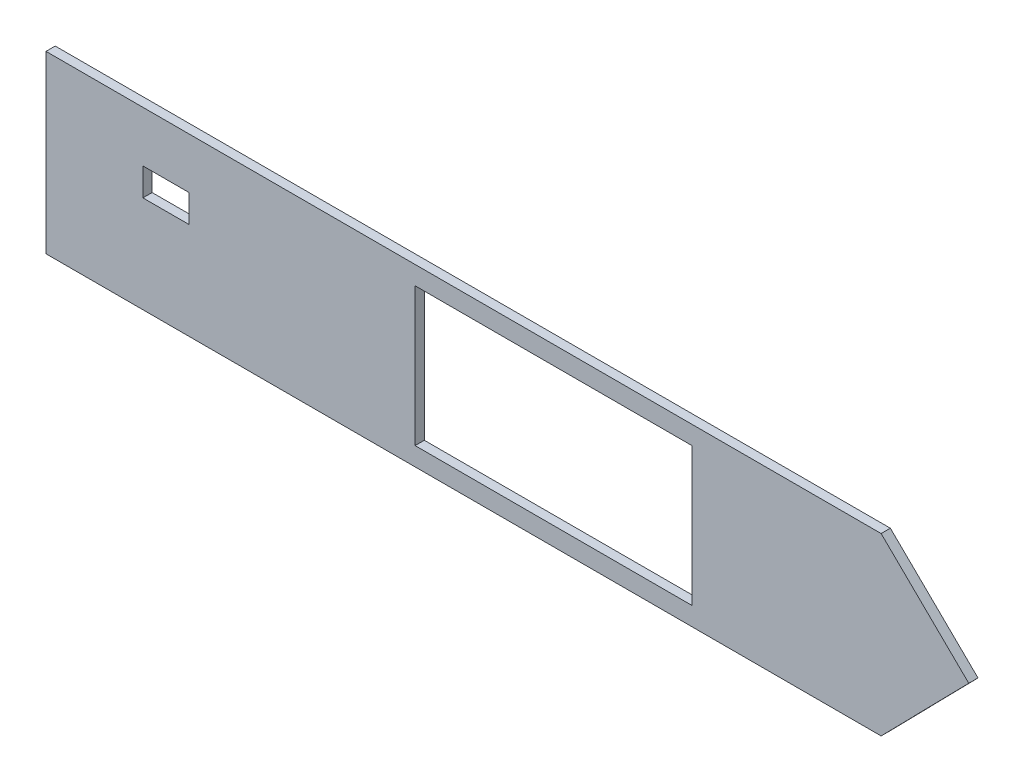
ISO-10303-21;
HEADER;
FILE_DESCRIPTION(('STEP AP214'),'2;1');
FILE_NAME('part.step','',(''),(''),'','','');
FILE_SCHEMA(('AUTOMOTIVE_DESIGN { 1 0 10303 214 1 1 1 1 }'));
ENDSEC;
DATA;
#1=APPLICATION_CONTEXT('core data for automotive mechanical design processes');
#2=APPLICATION_PROTOCOL_DEFINITION('international standard','automotive_design',2000,#1);
#3=PRODUCT_CONTEXT('',#1,'mechanical');
#4=PRODUCT('Part','Part','',(#3));
#5=PRODUCT_RELATED_PRODUCT_CATEGORY('part','',(#4));
#6=PRODUCT_DEFINITION_FORMATION('','',#4);
#7=PRODUCT_DEFINITION_CONTEXT('part definition',#1,'design');
#8=PRODUCT_DEFINITION('design','',#6,#7);
#9=PRODUCT_DEFINITION_SHAPE('','',#8);
#10=(LENGTH_UNIT() NAMED_UNIT(*) SI_UNIT(.MILLI.,.METRE.));
#11=(NAMED_UNIT(*) PLANE_ANGLE_UNIT() SI_UNIT($,.RADIAN.));
#12=(NAMED_UNIT(*) SI_UNIT($,.STERADIAN.) SOLID_ANGLE_UNIT());
#13=UNCERTAINTY_MEASURE_WITH_UNIT(LENGTH_MEASURE(1.E-05),#10,'distance_accuracy_value','');
#14=(GEOMETRIC_REPRESENTATION_CONTEXT(3) GLOBAL_UNCERTAINTY_ASSIGNED_CONTEXT((#13)) GLOBAL_UNIT_ASSIGNED_CONTEXT((#10,
#11,#12)) REPRESENTATION_CONTEXT('',''));
#15=CARTESIAN_POINT('',(0.,0.,0.));
#16=DIRECTION('',(0.,0.,1.));
#17=DIRECTION('',(1.,0.,0.));
#18=AXIS2_PLACEMENT_3D('',#15,#16,#17);
#19=CARTESIAN_POINT('',(0.,0.,1.));
#20=DIRECTION('',(0.,0.,-1.));
#21=DIRECTION('',(-1.,0.,0.));
#22=AXIS2_PLACEMENT_3D('',#19,#20,#21);
#23=PLANE('',#22);
#24=DIRECTION('',(0.,-1.,0.));
#25=VECTOR('',#24,1.);
#26=CARTESIAN_POINT('',(0.,0.,1.));
#27=LINE('',#26,#25);
#28=CARTESIAN_POINT('',(0.,15.,1.));
#29=VERTEX_POINT('',#28);
#30=CARTESIAN_POINT('',(0.,0.,1.));
#31=VERTEX_POINT('',#30);
#32=EDGE_CURVE('E168',#29,#31,#27,.T.);
#33=ORIENTED_EDGE('',*,*,#32,.F.);
#34=DIRECTION('',(-1.,0.,0.));
#35=VECTOR('',#34,1.);
#36=CARTESIAN_POINT('',(0.,15.,1.));
#37=LINE('',#36,#35);
#38=CARTESIAN_POINT('',(30.,15.,1.));
#39=VERTEX_POINT('',#38);
#40=EDGE_CURVE('E176',#39,#29,#37,.T.);
#41=ORIENTED_EDGE('',*,*,#40,.F.);
#42=DIRECTION('',(0.,1.,0.));
#43=VECTOR('',#42,1.);
#44=CARTESIAN_POINT('',(30.,0.,1.));
#45=LINE('',#44,#43);
#46=CARTESIAN_POINT('',(30.,0.,1.));
#47=VERTEX_POINT('',#46);
#48=EDGE_CURVE('E173',#47,#39,#45,.T.);
#49=ORIENTED_EDGE('',*,*,#48,.F.);
#50=DIRECTION('',(1.,0.,0.));
#51=VECTOR('',#50,1.);
#52=CARTESIAN_POINT('',(0.,0.,1.));
#53=LINE('',#52,#51);
#54=EDGE_CURVE('E170',#31,#47,#53,.T.);
#55=ORIENTED_EDGE('',*,*,#54,.F.);
#56=EDGE_LOOP('',(#33,#41,#49,#55));
#57=FACE_BOUND('',#56,.T.);
#58=DIRECTION('',(0.,-1.,0.));
#59=VECTOR('',#58,1.);
#60=CARTESIAN_POINT('',(-40.,17.,1.));
#61=LINE('',#60,#59);
#62=CARTESIAN_POINT('',(-40.,17.,1.));
#63=VERTEX_POINT('',#62);
#64=CARTESIAN_POINT('',(-40.,-2.00000000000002,1.));
#65=VERTEX_POINT('',#64);
#66=EDGE_CURVE('E199',#63,#65,#61,.T.);
#67=ORIENTED_EDGE('',*,*,#66,.T.);
#68=DIRECTION('',(1.,0.,0.));
#69=VECTOR('',#68,1.);
#70=CARTESIAN_POINT('',(50.5020143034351,-2.,1.));
#71=LINE('',#70,#69);
#72=CARTESIAN_POINT('',(50.5020143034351,-2.,1.));
#73=VERTEX_POINT('',#72);
#74=EDGE_CURVE('E202',#65,#73,#71,.T.);
#75=ORIENTED_EDGE('',*,*,#74,.T.);
#76=DIRECTION('',(0.699788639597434,0.714349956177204,0.));
#77=VECTOR('',#76,1.);
#78=CARTESIAN_POINT('',(60.,7.69562133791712,1.));
#79=LINE('',#78,#77);
#80=CARTESIAN_POINT('',(60.,7.69562133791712,1.));
#81=VERTEX_POINT('',#80);
#82=EDGE_CURVE('E205',#73,#81,#79,.T.);
#83=ORIENTED_EDGE('',*,*,#82,.T.);
#84=DIRECTION('',(-0.714349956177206,0.699788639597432,0.));
#85=VECTOR('',#84,1.);
#86=CARTESIAN_POINT('',(50.5020143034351,17.,1.));
#87=LINE('',#86,#85);
#88=CARTESIAN_POINT('',(50.5020143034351,17.,1.));
#89=VERTEX_POINT('',#88);
#90=EDGE_CURVE('E207',#81,#89,#87,.T.);
#91=ORIENTED_EDGE('',*,*,#90,.T.);
#92=DIRECTION('',(-1.,0.,0.));
#93=VECTOR('',#92,1.);
#94=CARTESIAN_POINT('',(-40.,17.,1.));
#95=LINE('',#94,#93);
#96=EDGE_CURVE('E209',#89,#63,#95,.T.);
#97=ORIENTED_EDGE('',*,*,#96,.T.);
#98=EDGE_LOOP('',(#67,#75,#83,#91,#97));
#99=FACE_BOUND('',#98,.T.);
#100=DIRECTION('',(0.,-1.,0.));
#101=VECTOR('',#100,1.);
#102=CARTESIAN_POINT('',(-29.5,11.5,1.));
#103=LINE('',#102,#101);
#104=CARTESIAN_POINT('',(-29.5,11.5,1.));
#105=VERTEX_POINT('',#104);
#106=CARTESIAN_POINT('',(-29.5,8.5,1.));
#107=VERTEX_POINT('',#106);
#108=EDGE_CURVE('E132',#105,#107,#103,.T.);
#109=ORIENTED_EDGE('',*,*,#108,.F.);
#110=DIRECTION('',(-1.,0.,0.));
#111=VECTOR('',#110,1.);
#112=CARTESIAN_POINT('',(-29.5,11.5,1.));
#113=LINE('',#112,#111);
#114=CARTESIAN_POINT('',(-24.5,11.5,1.));
#115=VERTEX_POINT('',#114);
#116=EDGE_CURVE('E154',#115,#105,#113,.T.);
#117=ORIENTED_EDGE('',*,*,#116,.F.);
#118=DIRECTION('',(0.,1.,0.));
#119=VECTOR('',#118,1.);
#120=CARTESIAN_POINT('',(-24.5,11.5,1.));
#121=LINE('',#120,#119);
#122=CARTESIAN_POINT('',(-24.5,8.5,1.));
#123=VERTEX_POINT('',#122);
#124=EDGE_CURVE('E152',#123,#115,#121,.T.);
#125=ORIENTED_EDGE('',*,*,#124,.F.);
#126=DIRECTION('',(1.,0.,0.));
#127=VECTOR('',#126,1.);
#128=CARTESIAN_POINT('',(-29.5,8.5,1.));
#129=LINE('',#128,#127);
#130=EDGE_CURVE('E140',#107,#123,#129,.T.);
#131=ORIENTED_EDGE('',*,*,#130,.F.);
#132=EDGE_LOOP('',(#109,#117,#125,#131));
#133=FACE_BOUND('',#132,.T.);
#134=ADVANCED_FACE('F37',(#57,#99,#133),#23,.F.);
#135=CARTESIAN_POINT('',(0.,0.,0.));
#136=DIRECTION('',(0.,0.,-1.));
#137=DIRECTION('',(-1.,0.,0.));
#138=AXIS2_PLACEMENT_3D('',#135,#136,#137);
#139=PLANE('',#138);
#140=DIRECTION('',(-1.,0.,0.));
#141=VECTOR('',#140,1.);
#142=CARTESIAN_POINT('',(0.,15.,0.));
#143=LINE('',#142,#141);
#144=CARTESIAN_POINT('',(30.,15.,0.));
#145=VERTEX_POINT('',#144);
#146=CARTESIAN_POINT('',(0.,15.,0.));
#147=VERTEX_POINT('',#146);
#148=EDGE_CURVE('E171',#145,#147,#143,.T.);
#149=ORIENTED_EDGE('',*,*,#148,.T.);
#150=DIRECTION('',(0.,-1.,0.));
#151=VECTOR('',#150,1.);
#152=CARTESIAN_POINT('',(0.,0.,0.));
#153=LINE('',#152,#151);
#154=CARTESIAN_POINT('',(0.,0.,0.));
#155=VERTEX_POINT('',#154);
#156=EDGE_CURVE('E148',#147,#155,#153,.T.);
#157=ORIENTED_EDGE('',*,*,#156,.T.);
#158=DIRECTION('',(1.,0.,0.));
#159=VECTOR('',#158,1.);
#160=CARTESIAN_POINT('',(0.,0.,0.));
#161=LINE('',#160,#159);
#162=CARTESIAN_POINT('',(30.,0.,0.));
#163=VERTEX_POINT('',#162);
#164=EDGE_CURVE('E181',#155,#163,#161,.T.);
#165=ORIENTED_EDGE('',*,*,#164,.T.);
#166=DIRECTION('',(0.,1.,0.));
#167=VECTOR('',#166,1.);
#168=CARTESIAN_POINT('',(30.,0.,0.));
#169=LINE('',#168,#167);
#170=EDGE_CURVE('E184',#163,#145,#169,.T.);
#171=ORIENTED_EDGE('',*,*,#170,.T.);
#172=EDGE_LOOP('',(#149,#157,#165,#171));
#173=FACE_BOUND('',#172,.T.);
#174=DIRECTION('',(0.,-1.,0.));
#175=VECTOR('',#174,1.);
#176=CARTESIAN_POINT('',(-40.,17.,0.));
#177=LINE('',#176,#175);
#178=CARTESIAN_POINT('',(-40.,17.,0.));
#179=VERTEX_POINT('',#178);
#180=CARTESIAN_POINT('',(-40.,-2.00000000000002,0.));
#181=VERTEX_POINT('',#180);
#182=EDGE_CURVE('E198',#179,#181,#177,.T.);
#183=ORIENTED_EDGE('',*,*,#182,.F.);
#184=DIRECTION('',(-1.,0.,0.));
#185=VECTOR('',#184,1.);
#186=CARTESIAN_POINT('',(-40.,17.,0.));
#187=LINE('',#186,#185);
#188=CARTESIAN_POINT('',(50.5020143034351,17.,0.));
#189=VERTEX_POINT('',#188);
#190=EDGE_CURVE('E203',#189,#179,#187,.T.);
#191=ORIENTED_EDGE('',*,*,#190,.F.);
#192=DIRECTION('',(-0.714349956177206,0.699788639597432,0.));
#193=VECTOR('',#192,1.);
#194=CARTESIAN_POINT('',(50.5020143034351,17.,0.));
#195=LINE('',#194,#193);
#196=CARTESIAN_POINT('',(60.,7.69562133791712,0.));
#197=VERTEX_POINT('',#196);
#198=EDGE_CURVE('E218',#197,#189,#195,.T.);
#199=ORIENTED_EDGE('',*,*,#198,.F.);
#200=DIRECTION('',(0.699788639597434,0.714349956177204,0.));
#201=VECTOR('',#200,1.);
#202=CARTESIAN_POINT('',(60.,7.69562133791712,0.));
#203=LINE('',#202,#201);
#204=CARTESIAN_POINT('',(50.5020143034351,-2.,0.));
#205=VERTEX_POINT('',#204);
#206=EDGE_CURVE('E216',#205,#197,#203,.T.);
#207=ORIENTED_EDGE('',*,*,#206,.F.);
#208=DIRECTION('',(1.,0.,0.));
#209=VECTOR('',#208,1.);
#210=CARTESIAN_POINT('',(50.5020143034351,-2.,0.));
#211=LINE('',#210,#209);
#212=EDGE_CURVE('E214',#181,#205,#211,.T.);
#213=ORIENTED_EDGE('',*,*,#212,.F.);
#214=EDGE_LOOP('',(#183,#191,#199,#207,#213));
#215=FACE_BOUND('',#214,.T.);
#216=DIRECTION('',(-1.,0.,0.));
#217=VECTOR('',#216,1.);
#218=CARTESIAN_POINT('',(-29.5,11.5,0.));
#219=LINE('',#218,#217);
#220=CARTESIAN_POINT('',(-24.5,11.5,0.));
#221=VERTEX_POINT('',#220);
#222=CARTESIAN_POINT('',(-29.5,11.5,0.));
#223=VERTEX_POINT('',#222);
#224=EDGE_CURVE('E141',#221,#223,#219,.T.);
#225=ORIENTED_EDGE('',*,*,#224,.T.);
#226=DIRECTION('',(0.,-1.,0.));
#227=VECTOR('',#226,1.);
#228=CARTESIAN_POINT('',(-29.5,11.5,0.));
#229=LINE('',#228,#227);
#230=CARTESIAN_POINT('',(-29.5,8.5,0.));
#231=VERTEX_POINT('',#230);
#232=EDGE_CURVE('E60',#223,#231,#229,.T.);
#233=ORIENTED_EDGE('',*,*,#232,.T.);
#234=DIRECTION('',(1.,0.,0.));
#235=VECTOR('',#234,1.);
#236=CARTESIAN_POINT('',(-29.5,8.5,0.));
#237=LINE('',#236,#235);
#238=CARTESIAN_POINT('',(-24.5,8.5,0.));
#239=VERTEX_POINT('',#238);
#240=EDGE_CURVE('E147',#231,#239,#237,.T.);
#241=ORIENTED_EDGE('',*,*,#240,.T.);
#242=DIRECTION('',(0.,1.,0.));
#243=VECTOR('',#242,1.);
#244=CARTESIAN_POINT('',(-24.5,11.5,0.));
#245=LINE('',#244,#243);
#246=EDGE_CURVE('E160',#239,#221,#245,.T.);
#247=ORIENTED_EDGE('',*,*,#246,.T.);
#248=EDGE_LOOP('',(#225,#233,#241,#247));
#249=FACE_BOUND('',#248,.T.);
#250=ADVANCED_FACE('F239',(#173,#215,#249),#139,.T.);
#251=CARTESIAN_POINT('',(-40.,17.,1.));
#252=DIRECTION('',(1.,0.,0.));
#253=DIRECTION('',(0.,1.,0.));
#254=AXIS2_PLACEMENT_3D('',#251,#252,#253);
#255=PLANE('',#254);
#256=ORIENTED_EDGE('',*,*,#182,.T.);
#257=DIRECTION('',(0.,0.,-1.));
#258=VECTOR('',#257,1.);
#259=CARTESIAN_POINT('',(-40.,-2.00000000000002,1.));
#260=LINE('',#259,#258);
#261=EDGE_CURVE('E11',#65,#181,#260,.T.);
#262=ORIENTED_EDGE('',*,*,#261,.F.);
#263=ORIENTED_EDGE('',*,*,#66,.F.);
#264=DIRECTION('',(0.,0.,-1.));
#265=VECTOR('',#264,1.);
#266=CARTESIAN_POINT('',(-40.,17.,1.));
#267=LINE('',#266,#265);
#268=EDGE_CURVE('E211',#63,#179,#267,.T.);
#269=ORIENTED_EDGE('',*,*,#268,.T.);
#270=EDGE_LOOP('',(#256,#262,#263,#269));
#271=FACE_BOUND('',#270,.T.);
#272=ADVANCED_FACE('F39',(#271),#255,.F.);
#273=CARTESIAN_POINT('',(50.5020143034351,-2.,1.));
#274=DIRECTION('',(0.,1.,0.));
#275=DIRECTION('',(-1.,0.,0.));
#276=AXIS2_PLACEMENT_3D('',#273,#274,#275);
#277=PLANE('',#276);
#278=ORIENTED_EDGE('',*,*,#212,.T.);
#279=DIRECTION('',(0.,0.,-1.));
#280=VECTOR('',#279,1.);
#281=CARTESIAN_POINT('',(50.5020143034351,-2.,1.));
#282=LINE('',#281,#280);
#283=EDGE_CURVE('E45',#73,#205,#282,.T.);
#284=ORIENTED_EDGE('',*,*,#283,.F.);
#285=ORIENTED_EDGE('',*,*,#74,.F.);
#286=ORIENTED_EDGE('',*,*,#261,.T.);
#287=EDGE_LOOP('',(#278,#284,#285,#286));
#288=FACE_BOUND('',#287,.T.);
#289=ADVANCED_FACE('F253',(#288),#277,.F.);
#290=CARTESIAN_POINT('',(60.,7.69562133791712,1.));
#291=DIRECTION('',(-0.714349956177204,0.699788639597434,0.));
#292=DIRECTION('',(-0.699788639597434,-0.714349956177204,0.));
#293=AXIS2_PLACEMENT_3D('',#290,#291,#292);
#294=PLANE('',#293);
#295=ORIENTED_EDGE('',*,*,#206,.T.);
#296=DIRECTION('',(0.,0.,-1.));
#297=VECTOR('',#296,1.);
#298=CARTESIAN_POINT('',(60.,7.69562133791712,1.));
#299=LINE('',#298,#297);
#300=EDGE_CURVE('E226',#81,#197,#299,.T.);
#301=ORIENTED_EDGE('',*,*,#300,.F.);
#302=ORIENTED_EDGE('',*,*,#82,.F.);
#303=ORIENTED_EDGE('',*,*,#283,.T.);
#304=EDGE_LOOP('',(#295,#301,#302,#303));
#305=FACE_BOUND('',#304,.T.);
#306=ADVANCED_FACE('F233',(#305),#294,.F.);
#307=CARTESIAN_POINT('',(50.5020143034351,17.,1.));
#308=DIRECTION('',(-0.699788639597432,-0.714349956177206,0.));
#309=DIRECTION('',(0.714349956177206,-0.699788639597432,0.));
#310=AXIS2_PLACEMENT_3D('',#307,#308,#309);
#311=PLANE('',#310);
#312=ORIENTED_EDGE('',*,*,#198,.T.);
#313=DIRECTION('',(0.,0.,-1.));
#314=VECTOR('',#313,1.);
#315=CARTESIAN_POINT('',(50.5020143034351,17.,1.));
#316=LINE('',#315,#314);
#317=EDGE_CURVE('E223',#89,#189,#316,.T.);
#318=ORIENTED_EDGE('',*,*,#317,.F.);
#319=ORIENTED_EDGE('',*,*,#90,.F.);
#320=ORIENTED_EDGE('',*,*,#300,.T.);
#321=EDGE_LOOP('',(#312,#318,#319,#320));
#322=FACE_BOUND('',#321,.T.);
#323=ADVANCED_FACE('F244',(#322),#311,.F.);
#324=CARTESIAN_POINT('',(-40.,17.,1.));
#325=DIRECTION('',(0.,-1.,0.));
#326=DIRECTION('',(1.,0.,0.));
#327=AXIS2_PLACEMENT_3D('',#324,#325,#326);
#328=PLANE('',#327);
#329=ORIENTED_EDGE('',*,*,#190,.T.);
#330=ORIENTED_EDGE('',*,*,#268,.F.);
#331=ORIENTED_EDGE('',*,*,#96,.F.);
#332=ORIENTED_EDGE('',*,*,#317,.T.);
#333=EDGE_LOOP('',(#329,#330,#331,#332));
#334=FACE_BOUND('',#333,.T.);
#335=ADVANCED_FACE('F248',(#334),#328,.F.);
#336=CARTESIAN_POINT('',(0.,0.,1.));
#337=DIRECTION('',(1.,0.,0.));
#338=DIRECTION('',(0.,0.,-1.));
#339=AXIS2_PLACEMENT_3D('',#336,#337,#338);
#340=PLANE('',#339);
#341=ORIENTED_EDGE('',*,*,#156,.F.);
#342=DIRECTION('',(0.,0.,-1.));
#343=VECTOR('',#342,1.);
#344=CARTESIAN_POINT('',(0.,15.,1.));
#345=LINE('',#344,#343);
#346=EDGE_CURVE('E178',#29,#147,#345,.T.);
#347=ORIENTED_EDGE('',*,*,#346,.F.);
#348=ORIENTED_EDGE('',*,*,#32,.T.);
#349=DIRECTION('',(0.,0.,-1.));
#350=VECTOR('',#349,1.);
#351=CARTESIAN_POINT('',(0.,0.,1.));
#352=LINE('',#351,#350);
#353=EDGE_CURVE('E195',#31,#155,#352,.T.);
#354=ORIENTED_EDGE('',*,*,#353,.T.);
#355=EDGE_LOOP('',(#341,#347,#348,#354));
#356=FACE_BOUND('',#355,.T.);
#357=ADVANCED_FACE('F269',(#356),#340,.T.);
#358=CARTESIAN_POINT('',(0.,0.,1.));
#359=DIRECTION('',(0.,1.,0.));
#360=DIRECTION('',(0.,0.,1.));
#361=AXIS2_PLACEMENT_3D('',#358,#359,#360);
#362=PLANE('',#361);
#363=ORIENTED_EDGE('',*,*,#164,.F.);
#364=ORIENTED_EDGE('',*,*,#353,.F.);
#365=ORIENTED_EDGE('',*,*,#54,.T.);
#366=DIRECTION('',(0.,0.,-1.));
#367=VECTOR('',#366,1.);
#368=CARTESIAN_POINT('',(30.,0.,1.));
#369=LINE('',#368,#367);
#370=EDGE_CURVE('E193',#47,#163,#369,.T.);
#371=ORIENTED_EDGE('',*,*,#370,.T.);
#372=EDGE_LOOP('',(#363,#364,#365,#371));
#373=FACE_BOUND('',#372,.T.);
#374=ADVANCED_FACE('F295',(#373),#362,.T.);
#375=CARTESIAN_POINT('',(30.,0.,1.));
#376=DIRECTION('',(-1.,0.,0.));
#377=DIRECTION('',(0.,0.,1.));
#378=AXIS2_PLACEMENT_3D('',#375,#376,#377);
#379=PLANE('',#378);
#380=ORIENTED_EDGE('',*,*,#170,.F.);
#381=ORIENTED_EDGE('',*,*,#370,.F.);
#382=ORIENTED_EDGE('',*,*,#48,.T.);
#383=DIRECTION('',(0.,0.,-1.));
#384=VECTOR('',#383,1.);
#385=CARTESIAN_POINT('',(30.,15.,1.));
#386=LINE('',#385,#384);
#387=EDGE_CURVE('E191',#39,#145,#386,.T.);
#388=ORIENTED_EDGE('',*,*,#387,.T.);
#389=EDGE_LOOP('',(#380,#381,#382,#388));
#390=FACE_BOUND('',#389,.T.);
#391=ADVANCED_FACE('F302',(#390),#379,.T.);
#392=CARTESIAN_POINT('',(0.,15.,1.));
#393=DIRECTION('',(0.,-1.,0.));
#394=DIRECTION('',(0.,0.,-1.));
#395=AXIS2_PLACEMENT_3D('',#392,#393,#394);
#396=PLANE('',#395);
#397=ORIENTED_EDGE('',*,*,#148,.F.);
#398=ORIENTED_EDGE('',*,*,#387,.F.);
#399=ORIENTED_EDGE('',*,*,#40,.T.);
#400=ORIENTED_EDGE('',*,*,#346,.T.);
#401=EDGE_LOOP('',(#397,#398,#399,#400));
#402=FACE_BOUND('',#401,.T.);
#403=ADVANCED_FACE('F309',(#402),#396,.T.);
#404=CARTESIAN_POINT('',(-29.5,11.5,1.));
#405=DIRECTION('',(1.,0.,0.));
#406=DIRECTION('',(0.,0.,-1.));
#407=AXIS2_PLACEMENT_3D('',#404,#405,#406);
#408=PLANE('',#407);
#409=ORIENTED_EDGE('',*,*,#232,.F.);
#410=DIRECTION('',(0.,0.,-1.));
#411=VECTOR('',#410,1.);
#412=CARTESIAN_POINT('',(-29.5,11.5,1.));
#413=LINE('',#412,#411);
#414=EDGE_CURVE('E136',#105,#223,#413,.T.);
#415=ORIENTED_EDGE('',*,*,#414,.F.);
#416=ORIENTED_EDGE('',*,*,#108,.T.);
#417=DIRECTION('',(0.,0.,-1.));
#418=VECTOR('',#417,1.);
#419=CARTESIAN_POINT('',(-29.5,8.5,1.));
#420=LINE('',#419,#418);
#421=EDGE_CURVE('E135',#107,#231,#420,.T.);
#422=ORIENTED_EDGE('',*,*,#421,.T.);
#423=EDGE_LOOP('',(#409,#415,#416,#422));
#424=FACE_BOUND('',#423,.T.);
#425=ADVANCED_FACE('F134',(#424),#408,.T.);
#426=CARTESIAN_POINT('',(-29.5,8.5,1.));
#427=DIRECTION('',(0.,1.,0.));
#428=DIRECTION('',(0.,0.,1.));
#429=AXIS2_PLACEMENT_3D('',#426,#427,#428);
#430=PLANE('',#429);
#431=ORIENTED_EDGE('',*,*,#240,.F.);
#432=ORIENTED_EDGE('',*,*,#421,.F.);
#433=ORIENTED_EDGE('',*,*,#130,.T.);
#434=DIRECTION('',(0.,0.,-1.));
#435=VECTOR('',#434,1.);
#436=CARTESIAN_POINT('',(-24.5,8.5,1.));
#437=LINE('',#436,#435);
#438=EDGE_CURVE('E149',#123,#239,#437,.T.);
#439=ORIENTED_EDGE('',*,*,#438,.T.);
#440=EDGE_LOOP('',(#431,#432,#433,#439));
#441=FACE_BOUND('',#440,.T.);
#442=ADVANCED_FACE('F144',(#441),#430,.T.);
#443=CARTESIAN_POINT('',(-24.5,11.5,1.));
#444=DIRECTION('',(-1.,0.,0.));
#445=DIRECTION('',(0.,0.,1.));
#446=AXIS2_PLACEMENT_3D('',#443,#444,#445);
#447=PLANE('',#446);
#448=ORIENTED_EDGE('',*,*,#246,.F.);
#449=ORIENTED_EDGE('',*,*,#438,.F.);
#450=ORIENTED_EDGE('',*,*,#124,.T.);
#451=DIRECTION('',(0.,0.,-1.));
#452=VECTOR('',#451,1.);
#453=CARTESIAN_POINT('',(-24.5,11.5,1.));
#454=LINE('',#453,#452);
#455=EDGE_CURVE('E52',#115,#221,#454,.T.);
#456=ORIENTED_EDGE('',*,*,#455,.T.);
#457=EDGE_LOOP('',(#448,#449,#450,#456));
#458=FACE_BOUND('',#457,.T.);
#459=ADVANCED_FACE('F330',(#458),#447,.T.);
#460=CARTESIAN_POINT('',(-29.5,11.5,1.));
#461=DIRECTION('',(0.,-1.,0.));
#462=DIRECTION('',(0.,0.,-1.));
#463=AXIS2_PLACEMENT_3D('',#460,#461,#462);
#464=PLANE('',#463);
#465=ORIENTED_EDGE('',*,*,#224,.F.);
#466=ORIENTED_EDGE('',*,*,#455,.F.);
#467=ORIENTED_EDGE('',*,*,#116,.T.);
#468=ORIENTED_EDGE('',*,*,#414,.T.);
#469=EDGE_LOOP('',(#465,#466,#467,#468));
#470=FACE_BOUND('',#469,.T.);
#471=ADVANCED_FACE('F337',(#470),#464,.T.);
#472=CLOSED_SHELL('',(#134,#250,#272,#289,#306,#323,#335,#357,#374,#391,#403,#425,#442,#459,#471));
#473=MANIFOLD_SOLID_BREP('B2',#472);
#474=ADVANCED_BREP_SHAPE_REPRESENTATION('',(#18,#473),#14);
#475=SHAPE_DEFINITION_REPRESENTATION(#9,#474);
ENDSEC;
END-ISO-10303-21;
